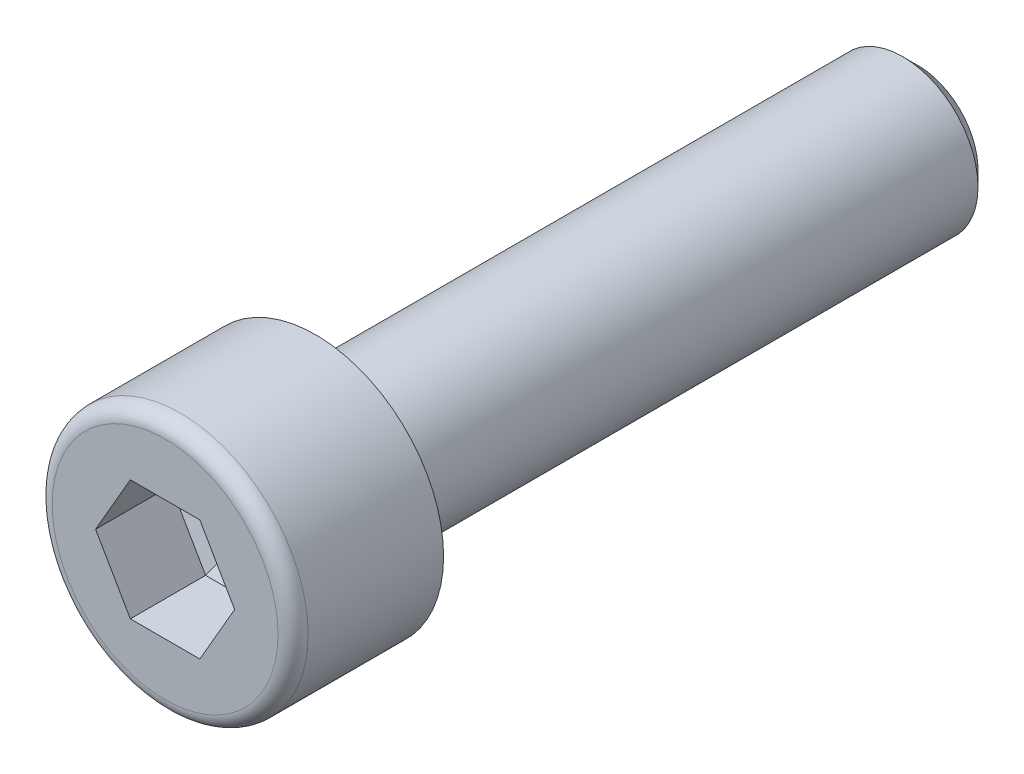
ISO-10303-21;
HEADER;
FILE_DESCRIPTION(('STEP AP214'),'2;1');
FILE_NAME('part.step','',(''),(''),'','','');
FILE_SCHEMA(('AUTOMOTIVE_DESIGN { 1 0 10303 214 1 1 1 1 }'));
ENDSEC;
DATA;
#1=APPLICATION_CONTEXT('core data for automotive mechanical design processes');
#2=APPLICATION_PROTOCOL_DEFINITION('international standard','automotive_design',2000,#1);
#3=PRODUCT_CONTEXT('',#1,'mechanical');
#4=PRODUCT('Part','Part','',(#3));
#5=PRODUCT_RELATED_PRODUCT_CATEGORY('part','',(#4));
#6=PRODUCT_DEFINITION_FORMATION('','',#4);
#7=PRODUCT_DEFINITION_CONTEXT('part definition',#1,'design');
#8=PRODUCT_DEFINITION('design','',#6,#7);
#9=PRODUCT_DEFINITION_SHAPE('','',#8);
#10=(LENGTH_UNIT() NAMED_UNIT(*) SI_UNIT(.MILLI.,.METRE.));
#11=(NAMED_UNIT(*) PLANE_ANGLE_UNIT() SI_UNIT($,.RADIAN.));
#12=(NAMED_UNIT(*) SI_UNIT($,.STERADIAN.) SOLID_ANGLE_UNIT());
#13=UNCERTAINTY_MEASURE_WITH_UNIT(LENGTH_MEASURE(1.E-05),#10,'distance_accuracy_value','');
#14=(GEOMETRIC_REPRESENTATION_CONTEXT(3) GLOBAL_UNCERTAINTY_ASSIGNED_CONTEXT((#13)) GLOBAL_UNIT_ASSIGNED_CONTEXT((#10,
#11,#12)) REPRESENTATION_CONTEXT('',''));
#15=CARTESIAN_POINT('',(0.,0.,0.));
#16=DIRECTION('',(0.,0.,1.));
#17=DIRECTION('',(1.,0.,0.));
#18=AXIS2_PLACEMENT_3D('',#15,#16,#17);
#19=CARTESIAN_POINT('',(0.,0.,0.));
#20=DIRECTION('',(0.,0.,1.));
#21=DIRECTION('',(1.,0.,0.));
#22=AXIS2_PLACEMENT_3D('',#19,#20,#21);
#23=PLANE('',#22);
#24=CARTESIAN_POINT('',(0.,0.,0.));
#25=DIRECTION('',(0.,0.,1.));
#26=DIRECTION('',(1.,0.,0.));
#27=AXIS2_PLACEMENT_3D('',#24,#25,#26);
#28=CIRCLE('',#27,4.25);
#29=CARTESIAN_POINT('',(4.25,0.,0.));
#30=VERTEX_POINT('',#29);
#31=EDGE_CURVE('E145',#30,#30,#28,.T.);
#32=ORIENTED_EDGE('',*,*,#31,.F.);
#33=EDGE_LOOP('',(#32));
#34=FACE_BOUND('',#33,.T.);
#35=CARTESIAN_POINT('',(0.,0.,0.));
#36=DIRECTION('',(0.,0.,1.));
#37=DIRECTION('',(1.,0.,0.));
#38=AXIS2_PLACEMENT_3D('',#35,#36,#37);
#39=CIRCLE('',#38,2.5);
#40=CARTESIAN_POINT('',(2.5,0.,0.));
#41=VERTEX_POINT('',#40);
#42=EDGE_CURVE('E169',#41,#41,#39,.F.);
#43=ORIENTED_EDGE('',*,*,#42,.F.);
#44=EDGE_LOOP('',(#43));
#45=FACE_BOUND('',#44,.T.);
#46=ADVANCED_FACE('F26',(#34,#45),#23,.F.);
#47=CARTESIAN_POINT('',(0.,0.,5.));
#48=DIRECTION('',(0.,0.,-1.));
#49=DIRECTION('',(-1.,0.,0.));
#50=AXIS2_PLACEMENT_3D('',#47,#48,#49);
#51=CYLINDRICAL_SURFACE('',#50,4.25);
#52=CARTESIAN_POINT('',(0.,0.,4.5));
#53=DIRECTION('',(0.,0.,1.));
#54=DIRECTION('',(1.,0.,0.));
#55=AXIS2_PLACEMENT_3D('',#52,#53,#54);
#56=CIRCLE('',#55,4.25);
#57=CARTESIAN_POINT('',(4.25,0.,4.5));
#58=VERTEX_POINT('',#57);
#59=EDGE_CURVE('E166',#58,#58,#56,.F.);
#60=ORIENTED_EDGE('',*,*,#59,.T.);
#61=EDGE_LOOP('',(#60));
#62=FACE_BOUND('',#61,.T.);
#63=ORIENTED_EDGE('',*,*,#31,.T.);
#64=EDGE_LOOP('',(#63));
#65=FACE_BOUND('',#64,.T.);
#66=ADVANCED_FACE('F28',(#62,#65),#51,.T.);
#67=CARTESIAN_POINT('',(0.,0.,5.));
#68=DIRECTION('',(0.,0.,1.));
#69=DIRECTION('',(1.,0.,0.));
#70=AXIS2_PLACEMENT_3D('',#67,#68,#69);
#71=PLANE('',#70);
#72=CARTESIAN_POINT('',(0.,0.,5.));
#73=DIRECTION('',(0.,0.,1.));
#74=DIRECTION('',(1.,0.,0.));
#75=AXIS2_PLACEMENT_3D('',#72,#73,#74);
#76=CIRCLE('',#75,3.75);
#77=CARTESIAN_POINT('',(3.75,0.,5.));
#78=VERTEX_POINT('',#77);
#79=EDGE_CURVE('E163',#78,#78,#76,.T.);
#80=ORIENTED_EDGE('',*,*,#79,.T.);
#81=EDGE_LOOP('',(#80));
#82=FACE_BOUND('',#81,.T.);
#83=DIRECTION('',(0.5,0.866025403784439,0.));
#84=VECTOR('',#83,1.);
#85=CARTESIAN_POINT('',(1.15470053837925,-2.,5.));
#86=LINE('',#85,#84);
#87=CARTESIAN_POINT('',(1.15470053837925,-2.,5.));
#88=VERTEX_POINT('',#87);
#89=CARTESIAN_POINT('',(2.3094010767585,0.,5.));
#90=VERTEX_POINT('',#89);
#91=EDGE_CURVE('E90',#88,#90,#86,.T.);
#92=ORIENTED_EDGE('',*,*,#91,.F.);
#93=DIRECTION('',(1.,0.,0.));
#94=VECTOR('',#93,1.);
#95=CARTESIAN_POINT('',(-1.15470053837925,-2.,5.));
#96=LINE('',#95,#94);
#97=CARTESIAN_POINT('',(-1.15470053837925,-2.,5.));
#98=VERTEX_POINT('',#97);
#99=EDGE_CURVE('E139',#98,#88,#96,.T.);
#100=ORIENTED_EDGE('',*,*,#99,.F.);
#101=DIRECTION('',(0.5,-0.866025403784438,0.));
#102=VECTOR('',#101,1.);
#103=CARTESIAN_POINT('',(-2.3094010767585,0.,5.));
#104=LINE('',#103,#102);
#105=CARTESIAN_POINT('',(-2.3094010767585,0.,5.));
#106=VERTEX_POINT('',#105);
#107=EDGE_CURVE('E136',#106,#98,#104,.T.);
#108=ORIENTED_EDGE('',*,*,#107,.F.);
#109=DIRECTION('',(-0.5,-0.866025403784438,0.));
#110=VECTOR('',#109,1.);
#111=CARTESIAN_POINT('',(-1.15470053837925,2.,5.));
#112=LINE('',#111,#110);
#113=CARTESIAN_POINT('',(-1.15470053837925,2.,5.));
#114=VERTEX_POINT('',#113);
#115=EDGE_CURVE('E133',#114,#106,#112,.T.);
#116=ORIENTED_EDGE('',*,*,#115,.F.);
#117=DIRECTION('',(-1.,0.,0.));
#118=VECTOR('',#117,1.);
#119=CARTESIAN_POINT('',(1.15470053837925,2.,5.));
#120=LINE('',#119,#118);
#121=CARTESIAN_POINT('',(1.15470053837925,2.,5.));
#122=VERTEX_POINT('',#121);
#123=EDGE_CURVE('E130',#122,#114,#120,.T.);
#124=ORIENTED_EDGE('',*,*,#123,.F.);
#125=DIRECTION('',(-0.5,0.866025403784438,0.));
#126=VECTOR('',#125,1.);
#127=CARTESIAN_POINT('',(2.3094010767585,0.,5.));
#128=LINE('',#127,#126);
#129=EDGE_CURVE('E127',#90,#122,#128,.T.);
#130=ORIENTED_EDGE('',*,*,#129,.F.);
#131=EDGE_LOOP('',(#92,#100,#108,#116,#124,#130));
#132=FACE_BOUND('',#131,.T.);
#133=ADVANCED_FACE('F192',(#82,#132),#71,.T.);
#134=CARTESIAN_POINT('',(1.15470053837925,-2.,1.5));
#135=DIRECTION('',(0.866025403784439,-0.5,0.));
#136=DIRECTION('',(0.5,0.866025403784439,0.));
#137=AXIS2_PLACEMENT_3D('',#134,#135,#136);
#138=PLANE('',#137);
#139=DIRECTION('',(0.,0.,1.));
#140=VECTOR('',#139,1.);
#141=CARTESIAN_POINT('',(2.3094010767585,0.,1.5));
#142=LINE('',#141,#140);
#143=CARTESIAN_POINT('',(2.3094010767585,0.,2.5));
#144=VERTEX_POINT('',#143);
#145=EDGE_CURVE('E142',#144,#90,#142,.T.);
#146=ORIENTED_EDGE('',*,*,#145,.F.);
#147=DIRECTION('',(-0.5,-0.866025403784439,0.));
#148=VECTOR('',#147,1.);
#149=CARTESIAN_POINT('',(1.15470053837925,-2.,2.5));
#150=LINE('',#149,#148);
#151=CARTESIAN_POINT('',(1.15470053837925,-2.,2.5));
#152=VERTEX_POINT('',#151);
#153=EDGE_CURVE('E112',#144,#152,#150,.T.);
#154=ORIENTED_EDGE('',*,*,#153,.T.);
#155=DIRECTION('',(0.,0.,1.));
#156=VECTOR('',#155,1.);
#157=CARTESIAN_POINT('',(1.15470053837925,-2.,1.5));
#158=LINE('',#157,#156);
#159=EDGE_CURVE('E143',#152,#88,#158,.T.);
#160=ORIENTED_EDGE('',*,*,#159,.T.);
#161=ORIENTED_EDGE('',*,*,#91,.T.);
#162=EDGE_LOOP('',(#146,#154,#160,#161));
#163=FACE_BOUND('',#162,.T.);
#164=ADVANCED_FACE('F197',(#163),#138,.F.);
#165=CARTESIAN_POINT('',(-1.15470053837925,-2.,1.5));
#166=DIRECTION('',(0.,-1.,0.));
#167=DIRECTION('',(1.,0.,0.));
#168=AXIS2_PLACEMENT_3D('',#165,#166,#167);
#169=PLANE('',#168);
#170=ORIENTED_EDGE('',*,*,#159,.F.);
#171=DIRECTION('',(-1.,0.,0.));
#172=VECTOR('',#171,1.);
#173=CARTESIAN_POINT('',(-1.15470053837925,-2.,2.5));
#174=LINE('',#173,#172);
#175=CARTESIAN_POINT('',(-1.15470053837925,-2.,2.5));
#176=VERTEX_POINT('',#175);
#177=EDGE_CURVE('E122',#152,#176,#174,.T.);
#178=ORIENTED_EDGE('',*,*,#177,.T.);
#179=DIRECTION('',(0.,0.,1.));
#180=VECTOR('',#179,1.);
#181=CARTESIAN_POINT('',(-1.15470053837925,-2.,1.5));
#182=LINE('',#181,#180);
#183=EDGE_CURVE('E146',#176,#98,#182,.T.);
#184=ORIENTED_EDGE('',*,*,#183,.T.);
#185=ORIENTED_EDGE('',*,*,#99,.T.);
#186=EDGE_LOOP('',(#170,#178,#184,#185));
#187=FACE_BOUND('',#186,.T.);
#188=ADVANCED_FACE('F204',(#187),#169,.F.);
#189=CARTESIAN_POINT('',(-2.3094010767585,0.,1.5));
#190=DIRECTION('',(-0.866025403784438,-0.5,0.));
#191=DIRECTION('',(0.5,-0.866025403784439,0.));
#192=AXIS2_PLACEMENT_3D('',#189,#190,#191);
#193=PLANE('',#192);
#194=ORIENTED_EDGE('',*,*,#183,.F.);
#195=DIRECTION('',(-0.5,0.866025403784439,0.));
#196=VECTOR('',#195,1.);
#197=CARTESIAN_POINT('',(-2.3094010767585,0.,2.5));
#198=LINE('',#197,#196);
#199=CARTESIAN_POINT('',(-2.3094010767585,0.,2.5));
#200=VERTEX_POINT('',#199);
#201=EDGE_CURVE('E116',#176,#200,#198,.T.);
#202=ORIENTED_EDGE('',*,*,#201,.T.);
#203=DIRECTION('',(0.,0.,1.));
#204=VECTOR('',#203,1.);
#205=CARTESIAN_POINT('',(-2.3094010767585,0.,1.5));
#206=LINE('',#205,#204);
#207=EDGE_CURVE('E148',#200,#106,#206,.T.);
#208=ORIENTED_EDGE('',*,*,#207,.T.);
#209=ORIENTED_EDGE('',*,*,#107,.T.);
#210=EDGE_LOOP('',(#194,#202,#208,#209));
#211=FACE_BOUND('',#210,.T.);
#212=ADVANCED_FACE('F217',(#211),#193,.F.);
#213=CARTESIAN_POINT('',(-1.15470053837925,2.,1.5));
#214=DIRECTION('',(-0.866025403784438,0.5,0.));
#215=DIRECTION('',(-0.5,-0.866025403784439,0.));
#216=AXIS2_PLACEMENT_3D('',#213,#214,#215);
#217=PLANE('',#216);
#218=ORIENTED_EDGE('',*,*,#207,.F.);
#219=DIRECTION('',(0.5,0.866025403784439,0.));
#220=VECTOR('',#219,1.);
#221=CARTESIAN_POINT('',(-1.15470053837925,2.,2.5));
#222=LINE('',#221,#220);
#223=CARTESIAN_POINT('',(-1.15470053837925,2.,2.5));
#224=VERTEX_POINT('',#223);
#225=EDGE_CURVE('E102',#200,#224,#222,.T.);
#226=ORIENTED_EDGE('',*,*,#225,.T.);
#227=DIRECTION('',(0.,0.,1.));
#228=VECTOR('',#227,1.);
#229=CARTESIAN_POINT('',(-1.15470053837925,2.,1.5));
#230=LINE('',#229,#228);
#231=EDGE_CURVE('E150',#224,#114,#230,.T.);
#232=ORIENTED_EDGE('',*,*,#231,.T.);
#233=ORIENTED_EDGE('',*,*,#115,.T.);
#234=EDGE_LOOP('',(#218,#226,#232,#233));
#235=FACE_BOUND('',#234,.T.);
#236=ADVANCED_FACE('F221',(#235),#217,.F.);
#237=CARTESIAN_POINT('',(1.15470053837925,2.,1.5));
#238=DIRECTION('',(0.,1.,0.));
#239=DIRECTION('',(-1.,0.,0.));
#240=AXIS2_PLACEMENT_3D('',#237,#238,#239);
#241=PLANE('',#240);
#242=ORIENTED_EDGE('',*,*,#231,.F.);
#243=DIRECTION('',(1.,0.,0.));
#244=VECTOR('',#243,1.);
#245=CARTESIAN_POINT('',(1.15470053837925,2.,2.5));
#246=LINE('',#245,#244);
#247=CARTESIAN_POINT('',(1.15470053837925,2.,2.5));
#248=VERTEX_POINT('',#247);
#249=EDGE_CURVE('E49',#224,#248,#246,.T.);
#250=ORIENTED_EDGE('',*,*,#249,.T.);
#251=DIRECTION('',(0.,0.,1.));
#252=VECTOR('',#251,1.);
#253=CARTESIAN_POINT('',(1.15470053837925,2.,1.5));
#254=LINE('',#253,#252);
#255=EDGE_CURVE('E152',#248,#122,#254,.T.);
#256=ORIENTED_EDGE('',*,*,#255,.T.);
#257=ORIENTED_EDGE('',*,*,#123,.T.);
#258=EDGE_LOOP('',(#242,#250,#256,#257));
#259=FACE_BOUND('',#258,.T.);
#260=ADVANCED_FACE('F222',(#259),#241,.F.);
#261=CARTESIAN_POINT('',(2.3094010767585,0.,1.5));
#262=DIRECTION('',(0.866025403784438,0.5,0.));
#263=DIRECTION('',(-0.5,0.866025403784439,0.));
#264=AXIS2_PLACEMENT_3D('',#261,#262,#263);
#265=PLANE('',#264);
#266=ORIENTED_EDGE('',*,*,#255,.F.);
#267=DIRECTION('',(0.5,-0.866025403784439,0.));
#268=VECTOR('',#267,1.);
#269=CARTESIAN_POINT('',(2.3094010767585,0.,2.5));
#270=LINE('',#269,#268);
#271=EDGE_CURVE('E41',#248,#144,#270,.T.);
#272=ORIENTED_EDGE('',*,*,#271,.T.);
#273=ORIENTED_EDGE('',*,*,#145,.T.);
#274=ORIENTED_EDGE('',*,*,#129,.T.);
#275=EDGE_LOOP('',(#266,#272,#273,#274));
#276=FACE_BOUND('',#275,.T.);
#277=ADVANCED_FACE('F223',(#276),#265,.F.);
#278=CARTESIAN_POINT('',(1.15470053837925,0.,1.5));
#279=DIRECTION('',(0.,-0.447213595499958,0.894427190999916));
#280=DIRECTION('',(0.,-0.894427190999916,-0.447213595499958));
#281=AXIS2_PLACEMENT_3D('',#278,#279,#280);
#282=PLANE('',#281);
#283=DIRECTION('',(-0.458831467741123,-0.794719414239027,-0.397359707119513));
#284=VECTOR('',#283,1.);
#285=CARTESIAN_POINT('',(0.243094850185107,0.421052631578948,1.71052631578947));
#286=LINE('',#285,#284);
#287=CARTESIAN_POINT('',(0.,0.,1.5));
#288=VERTEX_POINT('',#287);
#289=EDGE_CURVE('E86',#248,#288,#286,.T.);
#290=ORIENTED_EDGE('',*,*,#289,.F.);
#291=ORIENTED_EDGE('',*,*,#249,.F.);
#292=DIRECTION('',(0.458831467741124,-0.794719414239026,-0.397359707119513));
#293=VECTOR('',#292,1.);
#294=CARTESIAN_POINT('',(0.243094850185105,-0.421052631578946,1.28947368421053));
#295=LINE('',#294,#293);
#296=EDGE_CURVE('E83',#288,#224,#295,.F.);
#297=ORIENTED_EDGE('',*,*,#296,.F.);
#298=EDGE_LOOP('',(#290,#291,#297));
#299=FACE_BOUND('',#298,.T.);
#300=ADVANCED_FACE('F85',(#299),#282,.T.);
#301=CARTESIAN_POINT('',(-0.577350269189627,-0.999999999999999,1.5));
#302=DIRECTION('',(0.387298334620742,-0.223606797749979,0.894427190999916));
#303=DIRECTION('',(0.917662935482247,0.,-0.397359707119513));
#304=AXIS2_PLACEMENT_3D('',#301,#302,#303);
#305=PLANE('',#304);
#306=ORIENTED_EDGE('',*,*,#296,.T.);
#307=ORIENTED_EDGE('',*,*,#225,.F.);
#308=DIRECTION('',(0.917662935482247,0.,-0.397359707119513));
#309=VECTOR('',#308,1.);
#310=CARTESIAN_POINT('',(0.972379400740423,0.,1.07894736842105));
#311=LINE('',#310,#309);
#312=EDGE_CURVE('E98',#288,#200,#311,.F.);
#313=ORIENTED_EDGE('',*,*,#312,.F.);
#314=EDGE_LOOP('',(#306,#307,#313));
#315=FACE_BOUND('',#314,.T.);
#316=ADVANCED_FACE('F101',(#315),#305,.T.);
#317=CARTESIAN_POINT('',(1.15470053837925,-2.,1.5));
#318=DIRECTION('',(-0.387298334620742,-0.223606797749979,0.894427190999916));
#319=DIRECTION('',(0.917662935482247,0.,0.397359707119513));
#320=AXIS2_PLACEMENT_3D('',#317,#318,#319);
#321=PLANE('',#320);
#322=ORIENTED_EDGE('',*,*,#271,.F.);
#323=ORIENTED_EDGE('',*,*,#289,.T.);
#324=DIRECTION('',(-0.917662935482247,0.,-0.397359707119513));
#325=VECTOR('',#324,1.);
#326=CARTESIAN_POINT('',(0.972379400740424,0.,1.92105263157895));
#327=LINE('',#326,#325);
#328=EDGE_CURVE('E96',#144,#288,#327,.T.);
#329=ORIENTED_EDGE('',*,*,#328,.F.);
#330=EDGE_LOOP('',(#322,#323,#329));
#331=FACE_BOUND('',#330,.T.);
#332=ADVANCED_FACE('F94',(#331),#321,.T.);
#333=CARTESIAN_POINT('',(1.15470053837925,-2.,1.5));
#334=DIRECTION('',(0.387298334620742,0.223606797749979,0.894427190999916));
#335=DIRECTION('',(0.917662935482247,0.,-0.397359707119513));
#336=AXIS2_PLACEMENT_3D('',#333,#334,#335);
#337=PLANE('',#336);
#338=ORIENTED_EDGE('',*,*,#312,.T.);
#339=ORIENTED_EDGE('',*,*,#201,.F.);
#340=DIRECTION('',(0.458831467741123,0.794719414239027,-0.397359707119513));
#341=VECTOR('',#340,1.);
#342=CARTESIAN_POINT('',(0.243094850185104,0.421052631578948,1.28947368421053));
#343=LINE('',#342,#341);
#344=EDGE_CURVE('E113',#288,#176,#343,.F.);
#345=ORIENTED_EDGE('',*,*,#344,.F.);
#346=EDGE_LOOP('',(#338,#339,#345));
#347=FACE_BOUND('',#346,.T.);
#348=ADVANCED_FACE('F115',(#347),#337,.T.);
#349=CARTESIAN_POINT('',(-0.577350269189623,-1.,1.5));
#350=DIRECTION('',(-0.387298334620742,0.223606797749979,0.894427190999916));
#351=DIRECTION('',(0.917662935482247,0.,0.397359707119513));
#352=AXIS2_PLACEMENT_3D('',#349,#350,#351);
#353=PLANE('',#352);
#354=ORIENTED_EDGE('',*,*,#153,.F.);
#355=ORIENTED_EDGE('',*,*,#328,.T.);
#356=DIRECTION('',(0.458831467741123,-0.794719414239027,0.397359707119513));
#357=VECTOR('',#356,1.);
#358=CARTESIAN_POINT('',(0.243094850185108,-0.421052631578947,1.71052631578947));
#359=LINE('',#358,#357);
#360=EDGE_CURVE('E111',#152,#288,#359,.F.);
#361=ORIENTED_EDGE('',*,*,#360,.F.);
#362=EDGE_LOOP('',(#354,#355,#361));
#363=FACE_BOUND('',#362,.T.);
#364=ADVANCED_FACE('F109',(#363),#353,.T.);
#365=CARTESIAN_POINT('',(1.15470053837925,0.,1.5));
#366=DIRECTION('',(0.,0.447213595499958,0.894427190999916));
#367=DIRECTION('',(0.,-0.894427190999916,0.447213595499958));
#368=AXIS2_PLACEMENT_3D('',#365,#366,#367);
#369=PLANE('',#368);
#370=ORIENTED_EDGE('',*,*,#344,.T.);
#371=ORIENTED_EDGE('',*,*,#177,.F.);
#372=ORIENTED_EDGE('',*,*,#360,.T.);
#373=EDGE_LOOP('',(#370,#371,#372));
#374=FACE_BOUND('',#373,.T.);
#375=ADVANCED_FACE('F121',(#374),#369,.T.);
#376=CARTESIAN_POINT('',(0.,0.,4.5));
#377=DIRECTION('',(0.,0.,1.));
#378=DIRECTION('',(1.,0.,0.));
#379=AXIS2_PLACEMENT_3D('',#376,#377,#378);
#380=TOROIDAL_SURFACE('',#379,3.75,0.5);
#381=ORIENTED_EDGE('',*,*,#59,.F.);
#382=EDGE_LOOP('',(#381));
#383=FACE_BOUND('',#382,.T.);
#384=ORIENTED_EDGE('',*,*,#79,.F.);
#385=EDGE_LOOP('',(#384));
#386=FACE_BOUND('',#385,.T.);
#387=ADVANCED_FACE('F248',(#383,#386),#380,.T.);
#388=CARTESIAN_POINT('',(0.,0.,-20.));
#389=DIRECTION('',(0.,0.,1.));
#390=DIRECTION('',(1.,0.,0.));
#391=AXIS2_PLACEMENT_3D('',#388,#389,#390);
#392=CYLINDRICAL_SURFACE('',#391,2.5);
#393=CARTESIAN_POINT('',(0.,0.,-19.5));
#394=DIRECTION('',(0.,0.,-1.));
#395=DIRECTION('',(-1.,0.,0.));
#396=AXIS2_PLACEMENT_3D('',#393,#394,#395);
#397=CIRCLE('',#396,2.5);
#398=CARTESIAN_POINT('',(-2.5,0.,-19.5));
#399=VERTEX_POINT('',#398);
#400=EDGE_CURVE('E11',#399,#399,#397,.F.);
#401=ORIENTED_EDGE('',*,*,#400,.T.);
#402=EDGE_LOOP('',(#401));
#403=FACE_BOUND('',#402,.T.);
#404=ORIENTED_EDGE('',*,*,#42,.T.);
#405=EDGE_LOOP('',(#404));
#406=FACE_BOUND('',#405,.T.);
#407=ADVANCED_FACE('F183',(#403,#406),#392,.T.);
#408=CARTESIAN_POINT('',(0.,0.,-20.));
#409=DIRECTION('',(0.,0.,-1.));
#410=DIRECTION('',(-1.,0.,0.));
#411=AXIS2_PLACEMENT_3D('',#408,#409,#410);
#412=PLANE('',#411);
#413=CARTESIAN_POINT('',(0.,0.,-20.));
#414=DIRECTION('',(0.,0.,-1.));
#415=DIRECTION('',(-1.,0.,0.));
#416=AXIS2_PLACEMENT_3D('',#413,#414,#415);
#417=CIRCLE('',#416,1.99999999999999);
#418=CARTESIAN_POINT('',(-1.99999999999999,0.,-20.));
#419=VERTEX_POINT('',#418);
#420=EDGE_CURVE('E34',#419,#419,#417,.T.);
#421=ORIENTED_EDGE('',*,*,#420,.T.);
#422=EDGE_LOOP('',(#421));
#423=FACE_BOUND('',#422,.T.);
#424=ADVANCED_FACE('F174',(#423),#412,.T.);
#425=CARTESIAN_POINT('',(0.,0.,-20.));
#426=DIRECTION('',(0.,0.,1.));
#427=DIRECTION('',(1.,0.,0.));
#428=AXIS2_PLACEMENT_3D('',#425,#426,#427);
#429=CONICAL_SURFACE('',#428,1.99999999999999,0.785398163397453);
#430=ORIENTED_EDGE('',*,*,#400,.F.);
#431=EDGE_LOOP('',(#430));
#432=FACE_BOUND('',#431,.T.);
#433=ORIENTED_EDGE('',*,*,#420,.F.);
#434=EDGE_LOOP('',(#433));
#435=FACE_BOUND('',#434,.T.);
#436=ADVANCED_FACE('F176',(#432,#435),#429,.T.);
#437=CLOSED_SHELL('',(#46,#66,#133,#164,#188,#212,#236,#260,#277,#300,#316,#332,#348,#364,#375,
#387,#407,#424,#436));
#438=MANIFOLD_SOLID_BREP('B2',#437);
#439=ADVANCED_BREP_SHAPE_REPRESENTATION('',(#18,#438),#14);
#440=SHAPE_DEFINITION_REPRESENTATION(#9,#439);
ENDSEC;
END-ISO-10303-21;
